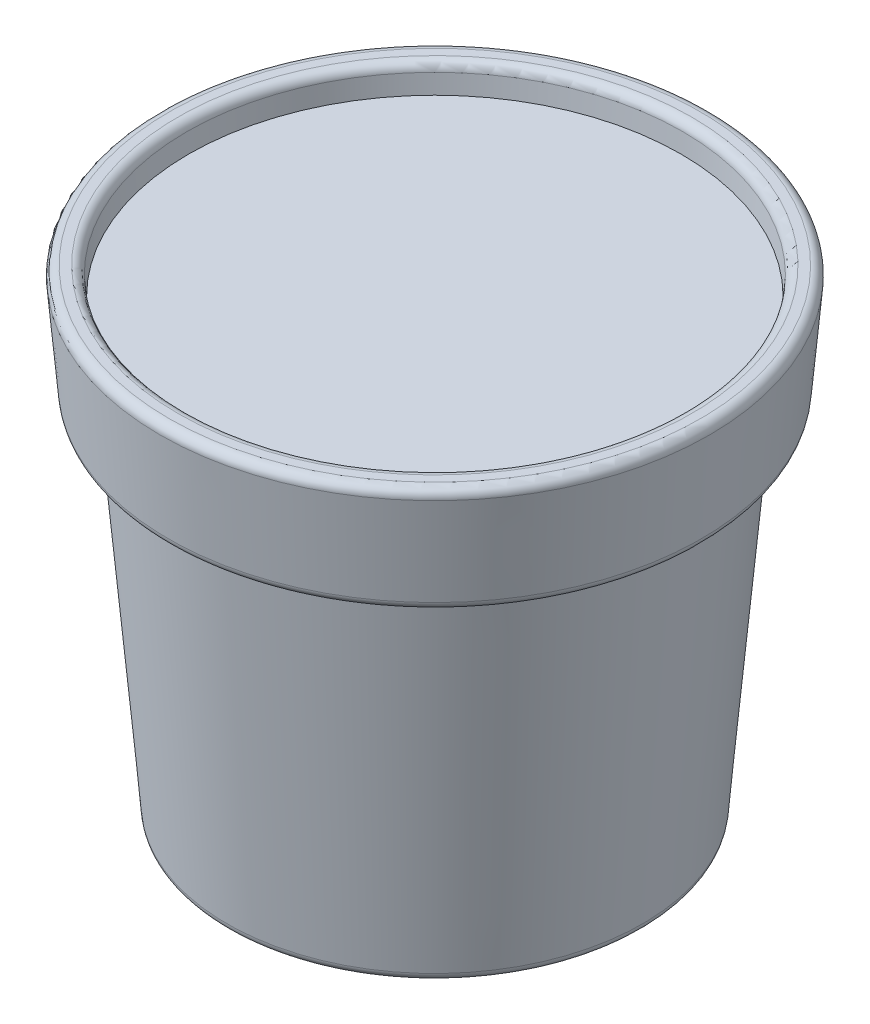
ISO-10303-21;
HEADER;
FILE_DESCRIPTION(('STEP AP214'),'2;1');
FILE_NAME('part.step','',(''),(''),'','','');
FILE_SCHEMA(('AUTOMOTIVE_DESIGN { 1 0 10303 214 1 1 1 1 }'));
ENDSEC;
DATA;
#1=APPLICATION_CONTEXT('core data for automotive mechanical design processes');
#2=APPLICATION_PROTOCOL_DEFINITION('international standard','automotive_design',2000,#1);
#3=PRODUCT_CONTEXT('',#1,'mechanical');
#4=PRODUCT('Part','Part','',(#3));
#5=PRODUCT_RELATED_PRODUCT_CATEGORY('part','',(#4));
#6=PRODUCT_DEFINITION_FORMATION('','',#4);
#7=PRODUCT_DEFINITION_CONTEXT('part definition',#1,'design');
#8=PRODUCT_DEFINITION('design','',#6,#7);
#9=PRODUCT_DEFINITION_SHAPE('','',#8);
#10=(LENGTH_UNIT() NAMED_UNIT(*) SI_UNIT(.MILLI.,.METRE.));
#11=(NAMED_UNIT(*) PLANE_ANGLE_UNIT() SI_UNIT($,.RADIAN.));
#12=(NAMED_UNIT(*) SI_UNIT($,.STERADIAN.) SOLID_ANGLE_UNIT());
#13=UNCERTAINTY_MEASURE_WITH_UNIT(LENGTH_MEASURE(1.E-05),#10,'distance_accuracy_value','');
#14=(GEOMETRIC_REPRESENTATION_CONTEXT(3) GLOBAL_UNCERTAINTY_ASSIGNED_CONTEXT((#13)) GLOBAL_UNIT_ASSIGNED_CONTEXT((#10,
#11,#12)) REPRESENTATION_CONTEXT('',''));
#15=CARTESIAN_POINT('',(0.,0.,0.));
#16=DIRECTION('',(0.,0.,1.));
#17=DIRECTION('',(1.,0.,0.));
#18=AXIS2_PLACEMENT_3D('',#15,#16,#17);
#19=CARTESIAN_POINT('',(46.251133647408,0.,0.));
#20=DIRECTION('',(0.,-1.,0.));
#21=DIRECTION('',(0.,0.,-1.));
#22=AXIS2_PLACEMENT_3D('',#19,#20,#21);
#23=PLANE('',#22);
#24=CARTESIAN_POINT('',(0.,0.,0.));
#25=DIRECTION('',(0.,-1.,0.));
#26=DIRECTION('',(0.,0.,-1.));
#27=AXIS2_PLACEMENT_3D('',#24,#25,#26);
#28=CIRCLE('',#27,44.4184712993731);
#29=CARTESIAN_POINT('',(0.,0.,-44.4184712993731));
#30=VERTEX_POINT('',#29);
#31=EDGE_CURVE('E42',#30,#30,#28,.T.);
#32=ORIENTED_EDGE('',*,*,#31,.T.);
#33=EDGE_LOOP('',(#32));
#34=FACE_BOUND('',#33,.T.);
#35=ADVANCED_FACE('F35',(#34),#23,.T.);
#36=CARTESIAN_POINT('',(0.,100.,0.));
#37=DIRECTION('',(0.,1.,0.));
#38=DIRECTION('',(0.,0.,1.));
#39=AXIS2_PLACEMENT_3D('',#36,#37,#38);
#40=PLANE('',#39);
#41=CARTESIAN_POINT('',(0.,100.,0.));
#42=DIRECTION('',(0.,-1.,0.));
#43=DIRECTION('',(0.,0.,-1.));
#44=AXIS2_PLACEMENT_3D('',#41,#42,#43);
#45=CIRCLE('',#44,55.);
#46=CARTESIAN_POINT('',(0.,100.,-55.));
#47=VERTEX_POINT('',#46);
#48=EDGE_CURVE('E67',#47,#47,#45,.T.);
#49=ORIENTED_EDGE('',*,*,#48,.F.);
#50=EDGE_LOOP('',(#49));
#51=FACE_BOUND('',#50,.T.);
#52=ADVANCED_FACE('F91',(#51),#40,.T.);
#53=CARTESIAN_POINT('',(0.,106.,0.));
#54=DIRECTION('',(0.,1.,0.));
#55=DIRECTION('',(0.,0.,1.));
#56=AXIS2_PLACEMENT_3D('',#53,#54,#55);
#57=CONICAL_SURFACE('',#56,55.5249319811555,0.087266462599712);
#58=CARTESIAN_POINT('',(0.,104.174311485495,0.));
#59=DIRECTION('',(0.,-1.,0.));
#60=DIRECTION('',(0.,0.,-1.));
#61=AXIS2_PLACEMENT_3D('',#58,#59,#60);
#62=CIRCLE('',#61,55.3652049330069);
#63=CARTESIAN_POINT('',(0.,104.174311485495,-55.3652049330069));
#64=VERTEX_POINT('',#63);
#65=EDGE_CURVE('E50',#64,#64,#62,.F.);
#66=ORIENTED_EDGE('',*,*,#65,.T.);
#67=EDGE_LOOP('',(#66));
#68=FACE_BOUND('',#67,.T.);
#69=ORIENTED_EDGE('',*,*,#48,.T.);
#70=EDGE_LOOP('',(#69));
#71=FACE_BOUND('',#70,.T.);
#72=ADVANCED_FACE('F96',(#68,#71),#57,.F.);
#73=CARTESIAN_POINT('',(55.5249319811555,106.,0.));
#74=DIRECTION('',(0.,1.,0.));
#75=DIRECTION('',(0.,0.,1.));
#76=AXIS2_PLACEMENT_3D('',#73,#74,#75);
#77=PLANE('',#76);
#78=CARTESIAN_POINT('',(0.,106.,0.));
#79=DIRECTION('',(0.,1.,0.));
#80=DIRECTION('',(0.,0.,1.));
#81=AXIS2_PLACEMENT_3D('',#78,#79,#80);
#82=CIRCLE('',#81,59.342314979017);
#83=CARTESIAN_POINT('',(0.,106.,59.342314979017));
#84=VERTEX_POINT('',#83);
#85=EDGE_CURVE('E55',#84,#84,#82,.T.);
#86=ORIENTED_EDGE('',*,*,#85,.T.);
#87=EDGE_LOOP('',(#86));
#88=FACE_BOUND('',#87,.T.);
#89=CARTESIAN_POINT('',(0.,106.,0.));
#90=DIRECTION('',(0.,1.,0.));
#91=DIRECTION('',(0.,0.,1.));
#92=AXIS2_PLACEMENT_3D('',#89,#90,#91);
#93=CIRCLE('',#92,57.3575943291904);
#94=CARTESIAN_POINT('',(0.,106.,57.3575943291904));
#95=VERTEX_POINT('',#94);
#96=EDGE_CURVE('E58',#95,#95,#93,.F.);
#97=ORIENTED_EDGE('',*,*,#96,.T.);
#98=EDGE_LOOP('',(#97));
#99=FACE_BOUND('',#98,.T.);
#100=ADVANCED_FACE('F87',(#88,#99),#77,.T.);
#101=CARTESIAN_POINT('',(0.,81.,0.));
#102=DIRECTION('',(0.,1.,0.));
#103=DIRECTION('',(0.,0.,1.));
#104=AXIS2_PLACEMENT_3D('',#101,#102,#103);
#105=CONICAL_SURFACE('',#104,59.3377153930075,0.0872664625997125);
#106=CARTESIAN_POINT('',(0.,103.825688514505,0.));
#107=DIRECTION('',(0.,-1.,0.));
#108=DIRECTION('',(0.,0.,-1.));
#109=AXIS2_PLACEMENT_3D('',#106,#107,#108);
#110=CIRCLE('',#109,61.3347043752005);
#111=CARTESIAN_POINT('',(0.,103.825688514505,-61.3347043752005));
#112=VERTEX_POINT('',#111);
#113=EDGE_CURVE('E61',#112,#112,#110,.T.);
#114=ORIENTED_EDGE('',*,*,#113,.T.);
#115=EDGE_LOOP('',(#114));
#116=FACE_BOUND('',#115,.T.);
#117=CARTESIAN_POINT('',(0.,82.8256885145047,0.));
#118=DIRECTION('',(0.,-1.,0.));
#119=DIRECTION('',(0.,0.,-1.));
#120=AXIS2_PLACEMENT_3D('',#117,#118,#119);
#121=CIRCLE('',#120,59.4974424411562);
#122=CARTESIAN_POINT('',(0.,82.8256885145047,-59.4974424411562));
#123=VERTEX_POINT('',#122);
#124=EDGE_CURVE('E64',#123,#123,#121,.F.);
#125=ORIENTED_EDGE('',*,*,#124,.T.);
#126=EDGE_LOOP('',(#125));
#127=FACE_BOUND('',#126,.T.);
#128=ADVANCED_FACE('F78',(#116,#127),#105,.T.);
#129=CARTESIAN_POINT('',(59.3377153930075,81.,0.));
#130=DIRECTION('',(0.,-1.,0.));
#131=DIRECTION('',(0.,0.,-1.));
#132=AXIS2_PLACEMENT_3D('',#129,#130,#131);
#133=PLANE('',#132);
#134=CARTESIAN_POINT('',(0.,81.,0.));
#135=DIRECTION('',(0.,-1.,0.));
#136=DIRECTION('',(0.,0.,-1.));
#137=AXIS2_PLACEMENT_3D('',#134,#135,#136);
#138=CIRCLE('',#137,57.5050530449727);
#139=CARTESIAN_POINT('',(0.,81.,-57.5050530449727));
#140=VERTEX_POINT('',#139);
#141=EDGE_CURVE('E46',#140,#140,#138,.T.);
#142=ORIENTED_EDGE('',*,*,#141,.T.);
#143=EDGE_LOOP('',(#142));
#144=FACE_BOUND('',#143,.T.);
#145=CARTESIAN_POINT('',(0.,81.,0.));
#146=DIRECTION('',(0.,-1.,0.));
#147=DIRECTION('',(0.,0.,-1.));
#148=AXIS2_PLACEMENT_3D('',#145,#146,#147);
#149=CIRCLE('',#148,53.3377153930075);
#150=CARTESIAN_POINT('',(0.,81.,-53.3377153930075));
#151=VERTEX_POINT('',#150);
#152=EDGE_CURVE('E70',#151,#151,#149,.T.);
#153=ORIENTED_EDGE('',*,*,#152,.F.);
#154=EDGE_LOOP('',(#153));
#155=FACE_BOUND('',#154,.T.);
#156=ADVANCED_FACE('F76',(#144,#155),#133,.T.);
#157=CARTESIAN_POINT('',(0.,0.,0.));
#158=DIRECTION('',(0.,1.,0.));
#159=DIRECTION('',(0.,0.,1.));
#160=AXIS2_PLACEMENT_3D('',#157,#158,#159);
#161=CONICAL_SURFACE('',#160,46.251133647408,0.0872664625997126);
#162=CARTESIAN_POINT('',(0.,1.82568851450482,0.));
#163=DIRECTION('',(0.,-1.,0.));
#164=DIRECTION('',(0.,0.,-1.));
#165=AXIS2_PLACEMENT_3D('',#162,#163,#164);
#166=CIRCLE('',#165,46.4108606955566);
#167=CARTESIAN_POINT('',(0.,1.82568851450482,-46.4108606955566));
#168=VERTEX_POINT('',#167);
#169=EDGE_CURVE('E10',#168,#168,#166,.F.);
#170=ORIENTED_EDGE('',*,*,#169,.T.);
#171=EDGE_LOOP('',(#170));
#172=FACE_BOUND('',#171,.T.);
#173=ORIENTED_EDGE('',*,*,#152,.T.);
#174=EDGE_LOOP('',(#173));
#175=FACE_BOUND('',#174,.T.);
#176=ADVANCED_FACE('F74',(#172,#175),#161,.T.);
#177=CARTESIAN_POINT('',(0.,104.,0.));
#178=DIRECTION('',(0.,1.,0.));
#179=DIRECTION('',(0.,0.,1.));
#180=AXIS2_PLACEMENT_3D('',#177,#178,#179);
#181=TOROIDAL_SURFACE('',#180,59.342314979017,2.);
#182=ORIENTED_EDGE('',*,*,#85,.F.);
#183=EDGE_LOOP('',(#182));
#184=FACE_BOUND('',#183,.T.);
#185=ORIENTED_EDGE('',*,*,#113,.F.);
#186=EDGE_LOOP('',(#185));
#187=FACE_BOUND('',#186,.T.);
#188=ADVANCED_FACE('F85',(#184,#187),#181,.T.);
#189=CARTESIAN_POINT('',(0.,104.,0.));
#190=DIRECTION('',(0.,1.,0.));
#191=DIRECTION('',(0.,0.,1.));
#192=AXIS2_PLACEMENT_3D('',#189,#190,#191);
#193=TOROIDAL_SURFACE('',#192,57.3575943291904,2.);
#194=ORIENTED_EDGE('',*,*,#65,.F.);
#195=EDGE_LOOP('',(#194));
#196=FACE_BOUND('',#195,.T.);
#197=ORIENTED_EDGE('',*,*,#96,.F.);
#198=EDGE_LOOP('',(#197));
#199=FACE_BOUND('',#198,.T.);
#200=ADVANCED_FACE('F103',(#196,#199),#193,.T.);
#201=CARTESIAN_POINT('',(0.,83.,0.));
#202=DIRECTION('',(0.,-1.,0.));
#203=DIRECTION('',(0.,0.,-1.));
#204=AXIS2_PLACEMENT_3D('',#201,#202,#203);
#205=TOROIDAL_SURFACE('',#204,57.5050530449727,2.);
#206=ORIENTED_EDGE('',*,*,#124,.F.);
#207=EDGE_LOOP('',(#206));
#208=FACE_BOUND('',#207,.T.);
#209=ORIENTED_EDGE('',*,*,#141,.F.);
#210=EDGE_LOOP('',(#209));
#211=FACE_BOUND('',#210,.T.);
#212=ADVANCED_FACE('F106',(#208,#211),#205,.T.);
#213=CARTESIAN_POINT('',(0.,2.,0.));
#214=DIRECTION('',(0.,-1.,0.));
#215=DIRECTION('',(0.,0.,-1.));
#216=AXIS2_PLACEMENT_3D('',#213,#214,#215);
#217=TOROIDAL_SURFACE('',#216,44.4184712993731,2.);
#218=ORIENTED_EDGE('',*,*,#169,.F.);
#219=EDGE_LOOP('',(#218));
#220=FACE_BOUND('',#219,.T.);
#221=ORIENTED_EDGE('',*,*,#31,.F.);
#222=EDGE_LOOP('',(#221));
#223=FACE_BOUND('',#222,.T.);
#224=ADVANCED_FACE('F37',(#220,#223),#217,.T.);
#225=CLOSED_SHELL('',(#35,#52,#72,#100,#128,#156,#176,#188,#200,#212,#224));
#226=MANIFOLD_SOLID_BREP('B2',#225);
#227=ADVANCED_BREP_SHAPE_REPRESENTATION('',(#18,#226),#14);
#228=SHAPE_DEFINITION_REPRESENTATION(#9,#227);
ENDSEC;
END-ISO-10303-21;
